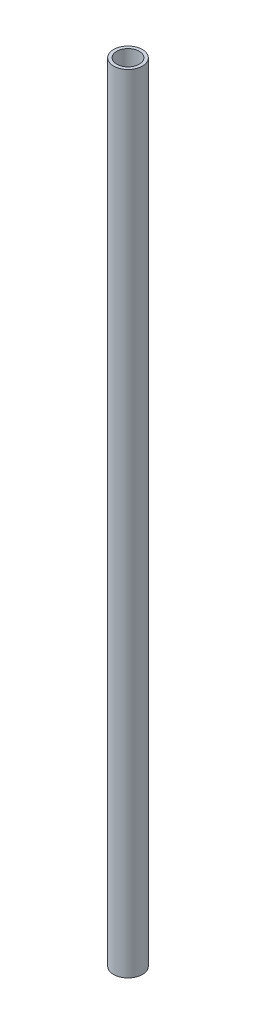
from build123d import *

# Parameters (mm, degrees)
SKETCH1_R           = 16.7005
SKETCH1_R_2         = 13.0683
BOSS_EXTRUDE1_DEPTH = 914.4


with BuildPart() as part:
    # Sketch1 → Boss-Extrude1 (new body)
    with BuildSketch(Plane(origin=(0, 0, 0), x_dir=(1, 0, 0), z_dir=(0, 1, 0))):
        with Locations(Location((0, 0, 0), (0, 0, 270))):
            Circle(SKETCH1_R)
        with Locations(Location((0, 0, 0), (0, 0, 270))):
            Circle(SKETCH1_R_2, mode=Mode.SUBTRACT)
    extrude(amount=BOSS_EXTRUDE1_DEPTH)


solid = part.part
